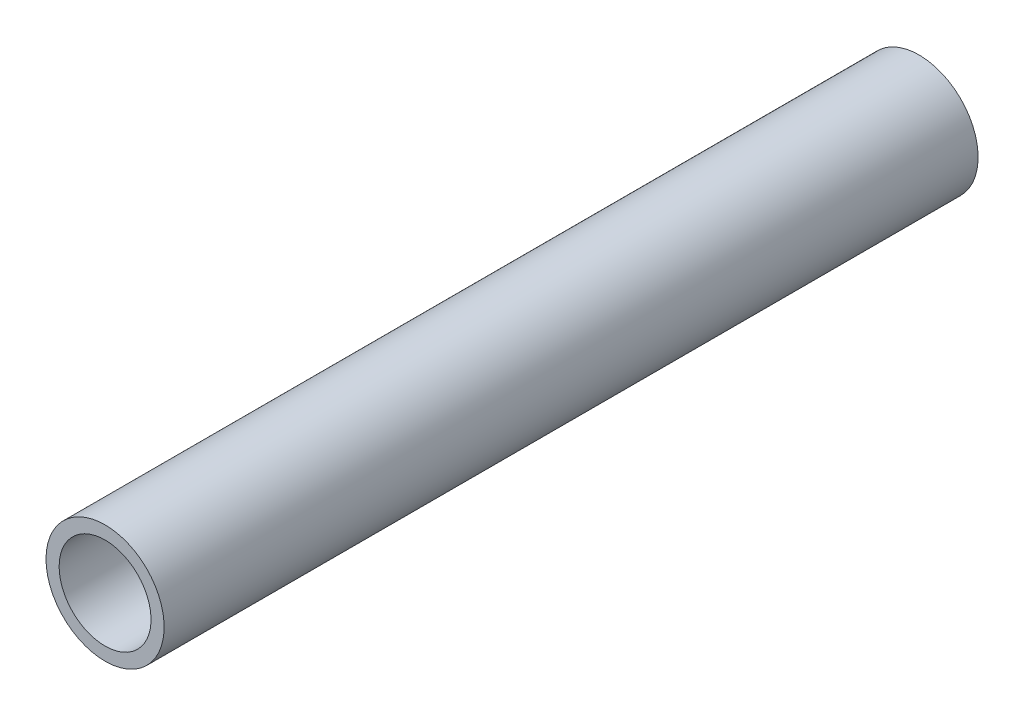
ISO-10303-21;
HEADER;
FILE_DESCRIPTION(('STEP AP214'),'2;1');
FILE_NAME('part.step','',(''),(''),'','','');
FILE_SCHEMA(('AUTOMOTIVE_DESIGN { 1 0 10303 214 1 1 1 1 }'));
ENDSEC;
DATA;
#1=APPLICATION_CONTEXT('core data for automotive mechanical design processes');
#2=APPLICATION_PROTOCOL_DEFINITION('international standard','automotive_design',2000,#1);
#3=PRODUCT_CONTEXT('',#1,'mechanical');
#4=PRODUCT('Part','Part','',(#3));
#5=PRODUCT_RELATED_PRODUCT_CATEGORY('part','',(#4));
#6=PRODUCT_DEFINITION_FORMATION('','',#4);
#7=PRODUCT_DEFINITION_CONTEXT('part definition',#1,'design');
#8=PRODUCT_DEFINITION('design','',#6,#7);
#9=PRODUCT_DEFINITION_SHAPE('','',#8);
#10=(LENGTH_UNIT() NAMED_UNIT(*) SI_UNIT(.MILLI.,.METRE.));
#11=(NAMED_UNIT(*) PLANE_ANGLE_UNIT() SI_UNIT($,.RADIAN.));
#12=(NAMED_UNIT(*) SI_UNIT($,.STERADIAN.) SOLID_ANGLE_UNIT());
#13=UNCERTAINTY_MEASURE_WITH_UNIT(LENGTH_MEASURE(1.E-05),#10,'distance_accuracy_value','');
#14=(GEOMETRIC_REPRESENTATION_CONTEXT(3) GLOBAL_UNCERTAINTY_ASSIGNED_CONTEXT((#13)) GLOBAL_UNIT_ASSIGNED_CONTEXT((#10,
#11,#12)) REPRESENTATION_CONTEXT('',''));
#15=CARTESIAN_POINT('',(0.,0.,0.));
#16=DIRECTION('',(0.,0.,1.));
#17=DIRECTION('',(1.,0.,0.));
#18=AXIS2_PLACEMENT_3D('',#15,#16,#17);
#19=CARTESIAN_POINT('',(0.,0.,186.));
#20=DIRECTION('',(0.,0.,1.));
#21=DIRECTION('',(1.,0.,0.));
#22=AXIS2_PLACEMENT_3D('',#19,#20,#21);
#23=PLANE('',#22);
#24=CARTESIAN_POINT('',(0.,0.,186.));
#25=DIRECTION('',(0.,0.,1.));
#26=DIRECTION('',(1.,0.,0.));
#27=AXIS2_PLACEMENT_3D('',#24,#25,#26);
#28=CIRCLE('',#27,13.5);
#29=CARTESIAN_POINT('',(-13.5,0.,186.));
#30=VERTEX_POINT('',#29);
#31=EDGE_CURVE('E11',#30,#30,#28,.T.);
#32=ORIENTED_EDGE('',*,*,#31,.T.);
#33=EDGE_LOOP('',(#32));
#34=FACE_BOUND('',#33,.T.);
#35=CARTESIAN_POINT('',(0.,0.,186.));
#36=DIRECTION('',(0.,0.,1.));
#37=DIRECTION('',(1.,0.,0.));
#38=AXIS2_PLACEMENT_3D('',#35,#36,#37);
#39=CIRCLE('',#38,10.5);
#40=CARTESIAN_POINT('',(-10.5,0.,186.));
#41=VERTEX_POINT('',#40);
#42=EDGE_CURVE('E49',#41,#41,#39,.T.);
#43=ORIENTED_EDGE('',*,*,#42,.F.);
#44=EDGE_LOOP('',(#43));
#45=FACE_BOUND('',#44,.T.);
#46=ADVANCED_FACE('F36',(#34,#45),#23,.T.);
#47=CARTESIAN_POINT('',(0.,0.,0.));
#48=DIRECTION('',(0.,0.,1.));
#49=DIRECTION('',(1.,0.,0.));
#50=AXIS2_PLACEMENT_3D('',#47,#48,#49);
#51=PLANE('',#50);
#52=CARTESIAN_POINT('',(0.,0.,0.));
#53=DIRECTION('',(0.,0.,1.));
#54=DIRECTION('',(1.,0.,0.));
#55=AXIS2_PLACEMENT_3D('',#52,#53,#54);
#56=CIRCLE('',#55,13.5);
#57=CARTESIAN_POINT('',(-13.5,0.,0.));
#58=VERTEX_POINT('',#57);
#59=EDGE_CURVE('E40',#58,#58,#56,.T.);
#60=ORIENTED_EDGE('',*,*,#59,.F.);
#61=EDGE_LOOP('',(#60));
#62=FACE_BOUND('',#61,.T.);
#63=CARTESIAN_POINT('',(0.,0.,0.));
#64=DIRECTION('',(0.,0.,1.));
#65=DIRECTION('',(1.,0.,0.));
#66=AXIS2_PLACEMENT_3D('',#63,#64,#65);
#67=CIRCLE('',#66,10.5);
#68=CARTESIAN_POINT('',(-10.5,0.,0.));
#69=VERTEX_POINT('',#68);
#70=EDGE_CURVE('E51',#69,#69,#67,.T.);
#71=ORIENTED_EDGE('',*,*,#70,.T.);
#72=EDGE_LOOP('',(#71));
#73=FACE_BOUND('',#72,.T.);
#74=ADVANCED_FACE('F63',(#62,#73),#51,.F.);
#75=CARTESIAN_POINT('',(0.,0.,186.));
#76=DIRECTION('',(0.,0.,-1.));
#77=DIRECTION('',(-1.,0.,0.));
#78=AXIS2_PLACEMENT_3D('',#75,#76,#77);
#79=CYLINDRICAL_SURFACE('',#78,13.5);
#80=CARTESIAN_POINT('',(-13.5,0.,186.));
#81=CARTESIAN_POINT('',(-13.5,0.,184.0625));
#82=CARTESIAN_POINT('',(-13.5,0.,182.125));
#83=CARTESIAN_POINT('',(-13.5,0.,178.25));
#84=CARTESIAN_POINT('',(-13.5,0.,176.3125));
#85=CARTESIAN_POINT('',(-13.5,0.,172.4375));
#86=CARTESIAN_POINT('',(-13.5,0.,170.5));
#87=CARTESIAN_POINT('',(-13.5,0.,166.625));
#88=CARTESIAN_POINT('',(-13.5,0.,164.6875));
#89=CARTESIAN_POINT('',(-13.5,0.,160.8125));
#90=CARTESIAN_POINT('',(-13.5,0.,158.875));
#91=CARTESIAN_POINT('',(-13.5,0.,155.));
#92=CARTESIAN_POINT('',(-13.5,0.,153.0625));
#93=CARTESIAN_POINT('',(-13.5,0.,149.1875));
#94=CARTESIAN_POINT('',(-13.5,0.,147.25));
#95=CARTESIAN_POINT('',(-13.5,0.,143.375));
#96=CARTESIAN_POINT('',(-13.5,0.,141.4375));
#97=CARTESIAN_POINT('',(-13.5,0.,137.5625));
#98=CARTESIAN_POINT('',(-13.5,0.,135.625));
#99=CARTESIAN_POINT('',(-13.5,0.,131.75));
#100=CARTESIAN_POINT('',(-13.5,0.,129.8125));
#101=CARTESIAN_POINT('',(-13.5,0.,125.9375));
#102=CARTESIAN_POINT('',(-13.5,0.,124.));
#103=CARTESIAN_POINT('',(-13.5,0.,120.125));
#104=CARTESIAN_POINT('',(-13.5,0.,118.1875));
#105=CARTESIAN_POINT('',(-13.5,0.,114.3125));
#106=CARTESIAN_POINT('',(-13.5,0.,112.375));
#107=CARTESIAN_POINT('',(-13.5,0.,108.5));
#108=CARTESIAN_POINT('',(-13.5,0.,106.5625));
#109=CARTESIAN_POINT('',(-13.5,0.,102.6875));
#110=CARTESIAN_POINT('',(-13.5,0.,100.75));
#111=CARTESIAN_POINT('',(-13.5,0.,96.875));
#112=CARTESIAN_POINT('',(-13.5,0.,94.9375));
#113=CARTESIAN_POINT('',(-13.5,0.,91.0625));
#114=CARTESIAN_POINT('',(-13.5,0.,89.125));
#115=CARTESIAN_POINT('',(-13.5,0.,85.25));
#116=CARTESIAN_POINT('',(-13.5,0.,83.3125));
#117=CARTESIAN_POINT('',(-13.5,0.,79.4375));
#118=CARTESIAN_POINT('',(-13.5,0.,77.5));
#119=CARTESIAN_POINT('',(-13.5,0.,73.625));
#120=CARTESIAN_POINT('',(-13.5,0.,71.6875));
#121=CARTESIAN_POINT('',(-13.5,0.,67.8125));
#122=CARTESIAN_POINT('',(-13.5,0.,65.875));
#123=CARTESIAN_POINT('',(-13.5,0.,62.));
#124=CARTESIAN_POINT('',(-13.5,0.,60.0625));
#125=CARTESIAN_POINT('',(-13.5,0.,56.1875));
#126=CARTESIAN_POINT('',(-13.5,0.,54.25));
#127=CARTESIAN_POINT('',(-13.5,0.,50.375));
#128=CARTESIAN_POINT('',(-13.5,0.,48.4375));
#129=CARTESIAN_POINT('',(-13.5,0.,44.5625));
#130=CARTESIAN_POINT('',(-13.5,0.,42.625));
#131=CARTESIAN_POINT('',(-13.5,0.,38.75));
#132=CARTESIAN_POINT('',(-13.5,0.,36.8125));
#133=CARTESIAN_POINT('',(-13.5,0.,32.9375));
#134=CARTESIAN_POINT('',(-13.5,0.,31.));
#135=CARTESIAN_POINT('',(-13.5,0.,27.125));
#136=CARTESIAN_POINT('',(-13.5,0.,25.1875));
#137=CARTESIAN_POINT('',(-13.5,0.,21.3125));
#138=CARTESIAN_POINT('',(-13.5,0.,19.375));
#139=CARTESIAN_POINT('',(-13.5,0.,15.5));
#140=CARTESIAN_POINT('',(-13.5,0.,13.5625));
#141=CARTESIAN_POINT('',(-13.5,0.,9.68749999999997));
#142=CARTESIAN_POINT('',(-13.5,0.,7.74999999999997));
#143=CARTESIAN_POINT('',(-13.5,0.,3.87499999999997));
#144=CARTESIAN_POINT('',(-13.5,0.,1.93749999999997));
#145=CARTESIAN_POINT('',(-13.5,0.,0.));
#146=B_SPLINE_CURVE_WITH_KNOTS('',3,(#80,#81,#82,#83,#84,#85,#86,#87,#88,#89,#90,#91,#92,#93,
#94,#95,#96,#97,#98,#99,#100,#101,#102,#103,#104,#105,#106,#107,#108,#109,#110,#111,#112,#113,
#114,#115,#116,#117,#118,#119,#120,#121,#122,#123,#124,#125,#126,#127,#128,#129,#130,#131,#132,
#133,#134,#135,#136,#137,#138,#139,#140,#141,#142,#143,#144,#145),.UNSPECIFIED.,.F.,.F.,(4,2,2,
2,2,2,2,2,2,2,2,2,2,2,2,2,2,2,2,2,2,2,2,2,2,2,2,2,2,2,2,2,4),(0.,5.8125,11.625,17.4375,23.25,
29.0625,34.875,40.6875,46.5,52.3125,58.125,63.9375,69.75,75.5625,81.375,87.1875,93.,98.8125,
104.625,110.4375,116.25,122.0625,127.875,133.6875,139.5,145.3125,151.125,156.9375,162.75,
168.5625,174.375,180.1875,186.),.UNSPECIFIED.);
#147=EDGE_CURVE('BSEAM38',#30,#58,#146,.T.);
#148=ORIENTED_EDGE('',*,*,#31,.F.);
#149=ORIENTED_EDGE('',*,*,#59,.T.);
#150=ORIENTED_EDGE('',*,*,#147,.T.);
#151=ORIENTED_EDGE('',*,*,#147,.F.);
#152=EDGE_LOOP('',(#148,#150,#149,#151));
#153=FACE_BOUND('',#152,.T.);
#154=ADVANCED_FACE('F38',(#153),#79,.T.);
#155=CARTESIAN_POINT('',(0.,0.,186.));
#156=DIRECTION('',(0.,0.,-1.));
#157=DIRECTION('',(-1.,0.,0.));
#158=AXIS2_PLACEMENT_3D('',#155,#156,#157);
#159=CYLINDRICAL_SURFACE('',#158,10.5);
#160=CARTESIAN_POINT('',(-10.5,0.,186.));
#161=CARTESIAN_POINT('',(-10.5,0.,184.0625));
#162=CARTESIAN_POINT('',(-10.5,0.,182.125));
#163=CARTESIAN_POINT('',(-10.5,0.,178.25));
#164=CARTESIAN_POINT('',(-10.5,0.,176.3125));
#165=CARTESIAN_POINT('',(-10.5,0.,172.4375));
#166=CARTESIAN_POINT('',(-10.5,0.,170.5));
#167=CARTESIAN_POINT('',(-10.5,0.,166.625));
#168=CARTESIAN_POINT('',(-10.5,0.,164.6875));
#169=CARTESIAN_POINT('',(-10.5,0.,160.8125));
#170=CARTESIAN_POINT('',(-10.5,0.,158.875));
#171=CARTESIAN_POINT('',(-10.5,0.,155.));
#172=CARTESIAN_POINT('',(-10.5,0.,153.0625));
#173=CARTESIAN_POINT('',(-10.5,0.,149.1875));
#174=CARTESIAN_POINT('',(-10.5,0.,147.25));
#175=CARTESIAN_POINT('',(-10.5,0.,143.375));
#176=CARTESIAN_POINT('',(-10.5,0.,141.4375));
#177=CARTESIAN_POINT('',(-10.5,0.,137.5625));
#178=CARTESIAN_POINT('',(-10.5,0.,135.625));
#179=CARTESIAN_POINT('',(-10.5,0.,131.75));
#180=CARTESIAN_POINT('',(-10.5,0.,129.8125));
#181=CARTESIAN_POINT('',(-10.5,0.,125.9375));
#182=CARTESIAN_POINT('',(-10.5,0.,124.));
#183=CARTESIAN_POINT('',(-10.5,0.,120.125));
#184=CARTESIAN_POINT('',(-10.5,0.,118.1875));
#185=CARTESIAN_POINT('',(-10.5,0.,114.3125));
#186=CARTESIAN_POINT('',(-10.5,0.,112.375));
#187=CARTESIAN_POINT('',(-10.5,0.,108.5));
#188=CARTESIAN_POINT('',(-10.5,0.,106.5625));
#189=CARTESIAN_POINT('',(-10.5,0.,102.6875));
#190=CARTESIAN_POINT('',(-10.5,0.,100.75));
#191=CARTESIAN_POINT('',(-10.5,0.,96.875));
#192=CARTESIAN_POINT('',(-10.5,0.,94.9375));
#193=CARTESIAN_POINT('',(-10.5,0.,91.0625));
#194=CARTESIAN_POINT('',(-10.5,0.,89.125));
#195=CARTESIAN_POINT('',(-10.5,0.,85.25));
#196=CARTESIAN_POINT('',(-10.5,0.,83.3125));
#197=CARTESIAN_POINT('',(-10.5,0.,79.4375));
#198=CARTESIAN_POINT('',(-10.5,0.,77.5));
#199=CARTESIAN_POINT('',(-10.5,0.,73.625));
#200=CARTESIAN_POINT('',(-10.5,0.,71.6875));
#201=CARTESIAN_POINT('',(-10.5,0.,67.8125));
#202=CARTESIAN_POINT('',(-10.5,0.,65.875));
#203=CARTESIAN_POINT('',(-10.5,0.,62.));
#204=CARTESIAN_POINT('',(-10.5,0.,60.0625));
#205=CARTESIAN_POINT('',(-10.5,0.,56.1875));
#206=CARTESIAN_POINT('',(-10.5,0.,54.25));
#207=CARTESIAN_POINT('',(-10.5,0.,50.375));
#208=CARTESIAN_POINT('',(-10.5,0.,48.4375));
#209=CARTESIAN_POINT('',(-10.5,0.,44.5625));
#210=CARTESIAN_POINT('',(-10.5,0.,42.625));
#211=CARTESIAN_POINT('',(-10.5,0.,38.75));
#212=CARTESIAN_POINT('',(-10.5,0.,36.8125));
#213=CARTESIAN_POINT('',(-10.5,0.,32.9375));
#214=CARTESIAN_POINT('',(-10.5,0.,31.));
#215=CARTESIAN_POINT('',(-10.5,0.,27.125));
#216=CARTESIAN_POINT('',(-10.5,0.,25.1875));
#217=CARTESIAN_POINT('',(-10.5,0.,21.3125));
#218=CARTESIAN_POINT('',(-10.5,0.,19.375));
#219=CARTESIAN_POINT('',(-10.5,0.,15.5));
#220=CARTESIAN_POINT('',(-10.5,0.,13.5625));
#221=CARTESIAN_POINT('',(-10.5,0.,9.68749999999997));
#222=CARTESIAN_POINT('',(-10.5,0.,7.74999999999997));
#223=CARTESIAN_POINT('',(-10.5,0.,3.87499999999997));
#224=CARTESIAN_POINT('',(-10.5,0.,1.93749999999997));
#225=CARTESIAN_POINT('',(-10.5,0.,0.));
#226=B_SPLINE_CURVE_WITH_KNOTS('',3,(#160,#161,#162,#163,#164,#165,#166,#167,#168,#169,#170,
#171,#172,#173,#174,#175,#176,#177,#178,#179,#180,#181,#182,#183,#184,#185,#186,#187,#188,#189,
#190,#191,#192,#193,#194,#195,#196,#197,#198,#199,#200,#201,#202,#203,#204,#205,#206,#207,#208,
#209,#210,#211,#212,#213,#214,#215,#216,#217,#218,#219,#220,#221,#222,#223,#224,#225),
.UNSPECIFIED.,.F.,.F.,(4,2,2,2,2,2,2,2,2,2,2,2,2,2,2,2,2,2,2,2,2,2,2,2,2,2,2,2,2,2,2,2,4),(0.,
5.81250000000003,11.625,17.4375,23.25,29.0625,34.875,40.6875,46.5,52.3125,58.125,63.9375,69.75,
75.5625,81.375,87.1875,93.,98.8125,104.625,110.4375,116.25,122.0625,127.875,133.6875,139.5,
145.3125,151.125,156.9375,162.75,168.5625,174.375,180.1875,186.),.UNSPECIFIED.);
#227=EDGE_CURVE('BSEAM59',#41,#69,#226,.T.);
#228=ORIENTED_EDGE('',*,*,#42,.T.);
#229=ORIENTED_EDGE('',*,*,#70,.F.);
#230=ORIENTED_EDGE('',*,*,#227,.T.);
#231=ORIENTED_EDGE('',*,*,#227,.F.);
#232=EDGE_LOOP('',(#228,#230,#229,#231));
#233=FACE_BOUND('',#232,.T.);
#234=ADVANCED_FACE('F59',(#233),#159,.F.);
#235=CLOSED_SHELL('',(#46,#74,#154,#234));
#236=MANIFOLD_SOLID_BREP('B2',#235);
#237=ADVANCED_BREP_SHAPE_REPRESENTATION('',(#18,#236),#14);
#238=SHAPE_DEFINITION_REPRESENTATION(#9,#237);
ENDSEC;
END-ISO-10303-21;
